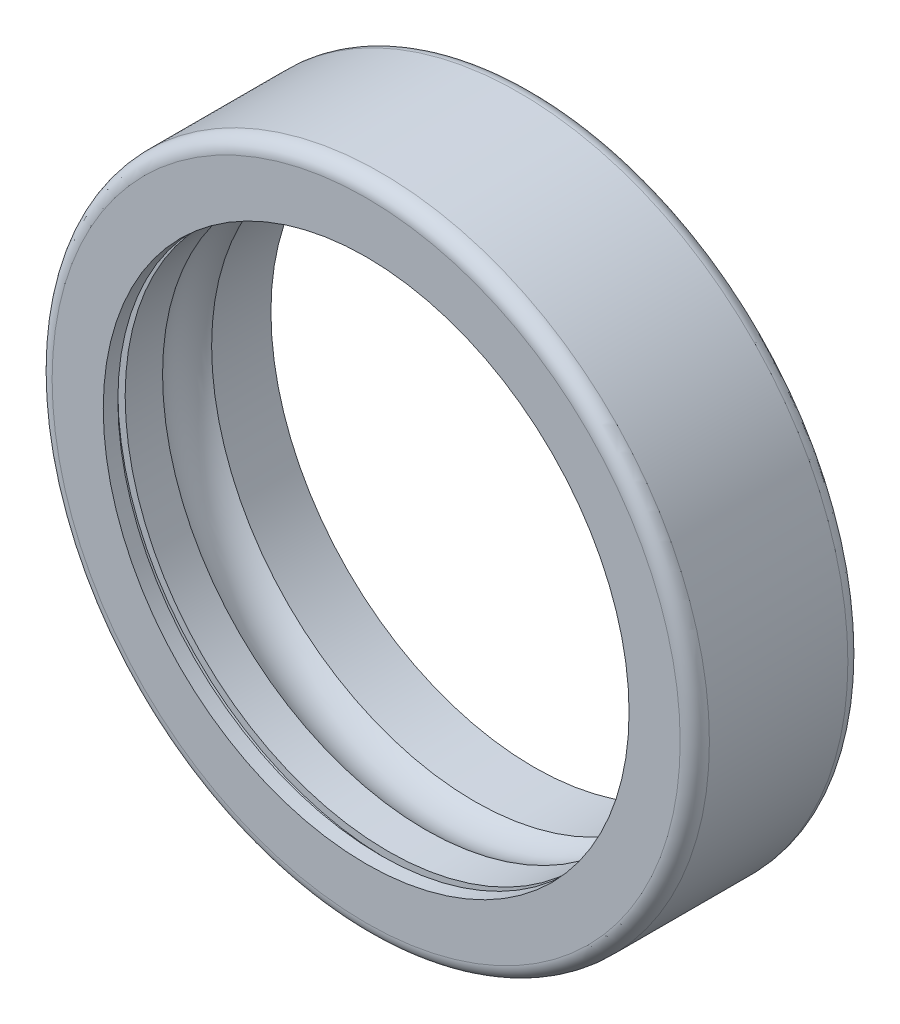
ISO-10303-21;
HEADER;
FILE_DESCRIPTION(('STEP AP214'),'2;1');
FILE_NAME('part.step','',(''),(''),'','','');
FILE_SCHEMA(('AUTOMOTIVE_DESIGN { 1 0 10303 214 1 1 1 1 }'));
ENDSEC;
DATA;
#1=APPLICATION_CONTEXT('core data for automotive mechanical design processes');
#2=APPLICATION_PROTOCOL_DEFINITION('international standard','automotive_design',2000,#1);
#3=PRODUCT_CONTEXT('',#1,'mechanical');
#4=PRODUCT('Part','Part','',(#3));
#5=PRODUCT_RELATED_PRODUCT_CATEGORY('part','',(#4));
#6=PRODUCT_DEFINITION_FORMATION('','',#4);
#7=PRODUCT_DEFINITION_CONTEXT('part definition',#1,'design');
#8=PRODUCT_DEFINITION('design','',#6,#7);
#9=PRODUCT_DEFINITION_SHAPE('','',#8);
#10=(LENGTH_UNIT() NAMED_UNIT(*) SI_UNIT(.MILLI.,.METRE.));
#11=(NAMED_UNIT(*) PLANE_ANGLE_UNIT() SI_UNIT($,.RADIAN.));
#12=(NAMED_UNIT(*) SI_UNIT($,.STERADIAN.) SOLID_ANGLE_UNIT());
#13=UNCERTAINTY_MEASURE_WITH_UNIT(LENGTH_MEASURE(1.E-05),#10,'distance_accuracy_value','');
#14=(GEOMETRIC_REPRESENTATION_CONTEXT(3) GLOBAL_UNCERTAINTY_ASSIGNED_CONTEXT((#13)) GLOBAL_UNIT_ASSIGNED_CONTEXT((#10,
#11,#12)) REPRESENTATION_CONTEXT('',''));
#15=CARTESIAN_POINT('',(0.,0.,0.));
#16=DIRECTION('',(0.,0.,1.));
#17=DIRECTION('',(1.,0.,0.));
#18=AXIS2_PLACEMENT_3D('',#15,#16,#17);
#19=CARTESIAN_POINT('',(0.,9.25,2.12));
#20=DIRECTION('',(0.,0.,1.));
#21=DIRECTION('',(1.,0.,0.));
#22=AXIS2_PLACEMENT_3D('',#19,#20,#21);
#23=PLANE('',#22);
#24=CARTESIAN_POINT('',(0.,0.,2.12));
#25=DIRECTION('',(0.,0.,-1.));
#26=DIRECTION('',(-1.,0.,0.));
#27=AXIS2_PLACEMENT_3D('',#24,#25,#26);
#28=CIRCLE('',#27,9.);
#29=CARTESIAN_POINT('',(-9.,0.,2.12));
#30=VERTEX_POINT('',#29);
#31=EDGE_CURVE('E10',#30,#30,#28,.T.);
#32=ORIENTED_EDGE('',*,*,#31,.T.);
#33=EDGE_LOOP('',(#32));
#34=FACE_BOUND('',#33,.T.);
#35=CARTESIAN_POINT('',(0.,0.,2.12));
#36=DIRECTION('',(0.,0.,-1.));
#37=DIRECTION('',(-1.,0.,0.));
#38=AXIS2_PLACEMENT_3D('',#35,#36,#37);
#39=CIRCLE('',#38,9.25);
#40=CARTESIAN_POINT('',(-9.25,0.,2.12));
#41=VERTEX_POINT('',#40);
#42=EDGE_CURVE('E70',#41,#41,#39,.T.);
#43=ORIENTED_EDGE('',*,*,#42,.F.);
#44=EDGE_LOOP('',(#43));
#45=FACE_BOUND('',#44,.T.);
#46=ADVANCED_FACE('F30',(#34,#45),#23,.T.);
#47=CARTESIAN_POINT('',(0.,0.,0.));
#48=DIRECTION('',(0.,0.,-1.));
#49=DIRECTION('',(-1.,0.,0.));
#50=AXIS2_PLACEMENT_3D('',#47,#48,#49);
#51=CYLINDRICAL_SURFACE('',#50,9.);
#52=ORIENTED_EDGE('',*,*,#31,.F.);
#53=EDGE_LOOP('',(#52));
#54=FACE_BOUND('',#53,.T.);
#55=CARTESIAN_POINT('',(0.,0.,0.840000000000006));
#56=DIRECTION('',(0.,0.,-1.));
#57=DIRECTION('',(-1.,0.,0.));
#58=AXIS2_PLACEMENT_3D('',#55,#56,#57);
#59=CIRCLE('',#58,9.);
#60=CARTESIAN_POINT('',(-9.,0.,0.840000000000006));
#61=VERTEX_POINT('',#60);
#62=EDGE_CURVE('E36',#61,#61,#59,.T.);
#63=ORIENTED_EDGE('',*,*,#62,.T.);
#64=EDGE_LOOP('',(#63));
#65=FACE_BOUND('',#64,.T.);
#66=ADVANCED_FACE('F78',(#54,#65),#51,.F.);
#67=CARTESIAN_POINT('',(0.,0.,0.));
#68=DIRECTION('',(0.,0.,-1.));
#69=DIRECTION('',(-1.,0.,0.));
#70=AXIS2_PLACEMENT_3D('',#67,#68,#69);
#71=TOROIDAL_SURFACE('',#70,7.88,1.4);
#72=ORIENTED_EDGE('',*,*,#62,.F.);
#73=EDGE_LOOP('',(#72));
#74=FACE_BOUND('',#73,.T.);
#75=CARTESIAN_POINT('',(0.,0.,-0.840000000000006));
#76=DIRECTION('',(0.,0.,-1.));
#77=DIRECTION('',(-1.,0.,0.));
#78=AXIS2_PLACEMENT_3D('',#75,#76,#77);
#79=CIRCLE('',#78,9.);
#80=CARTESIAN_POINT('',(-9.,0.,-0.840000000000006));
#81=VERTEX_POINT('',#80);
#82=EDGE_CURVE('E40',#81,#81,#79,.T.);
#83=ORIENTED_EDGE('',*,*,#82,.T.);
#84=EDGE_LOOP('',(#83));
#85=FACE_BOUND('',#84,.T.);
#86=ADVANCED_FACE('F82',(#74,#85),#71,.F.);
#87=CARTESIAN_POINT('',(0.,0.,0.));
#88=DIRECTION('',(0.,0.,-1.));
#89=DIRECTION('',(-1.,0.,0.));
#90=AXIS2_PLACEMENT_3D('',#87,#88,#89);
#91=CYLINDRICAL_SURFACE('',#90,9.);
#92=ORIENTED_EDGE('',*,*,#82,.F.);
#93=EDGE_LOOP('',(#92));
#94=FACE_BOUND('',#93,.T.);
#95=CARTESIAN_POINT('',(0.,0.,-2.87));
#96=DIRECTION('',(0.,0.,-1.));
#97=DIRECTION('',(-1.,0.,0.));
#98=AXIS2_PLACEMENT_3D('',#95,#96,#97);
#99=CIRCLE('',#98,9.);
#100=CARTESIAN_POINT('',(-9.,0.,-2.87));
#101=VERTEX_POINT('',#100);
#102=EDGE_CURVE('E44',#101,#101,#99,.T.);
#103=ORIENTED_EDGE('',*,*,#102,.T.);
#104=EDGE_LOOP('',(#103));
#105=FACE_BOUND('',#104,.T.);
#106=ADVANCED_FACE('F87',(#94,#105),#91,.F.);
#107=CARTESIAN_POINT('',(0.,9.,-2.87));
#108=DIRECTION('',(0.,0.,-1.));
#109=DIRECTION('',(-1.,0.,0.));
#110=AXIS2_PLACEMENT_3D('',#107,#108,#109);
#111=PLANE('',#110);
#112=CARTESIAN_POINT('',(0.,0.,-2.87));
#113=DIRECTION('',(0.,0.,-1.));
#114=DIRECTION('',(-1.,0.,0.));
#115=AXIS2_PLACEMENT_3D('',#112,#113,#114);
#116=CIRCLE('',#115,10.75);
#117=CARTESIAN_POINT('',(-10.75,0.,-2.87));
#118=VERTEX_POINT('',#117);
#119=EDGE_CURVE('E49',#118,#118,#116,.T.);
#120=ORIENTED_EDGE('',*,*,#119,.T.);
#121=EDGE_LOOP('',(#120));
#122=FACE_BOUND('',#121,.T.);
#123=ORIENTED_EDGE('',*,*,#102,.F.);
#124=EDGE_LOOP('',(#123));
#125=FACE_BOUND('',#124,.T.);
#126=ADVANCED_FACE('F93',(#122,#125),#111,.T.);
#127=CARTESIAN_POINT('',(0.,0.,-2.37));
#128=DIRECTION('',(0.,0.,-1.));
#129=DIRECTION('',(-1.,0.,0.));
#130=AXIS2_PLACEMENT_3D('',#127,#128,#129);
#131=TOROIDAL_SURFACE('',#130,10.75,0.499999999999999);
#132=CARTESIAN_POINT('',(0.,0.,-2.37));
#133=DIRECTION('',(0.,0.,-1.));
#134=DIRECTION('',(-1.,0.,0.));
#135=AXIS2_PLACEMENT_3D('',#132,#133,#134);
#136=CIRCLE('',#135,11.25);
#137=CARTESIAN_POINT('',(-11.25,0.,-2.37));
#138=VERTEX_POINT('',#137);
#139=EDGE_CURVE('E52',#138,#138,#136,.T.);
#140=ORIENTED_EDGE('',*,*,#139,.T.);
#141=EDGE_LOOP('',(#140));
#142=FACE_BOUND('',#141,.T.);
#143=ORIENTED_EDGE('',*,*,#119,.F.);
#144=EDGE_LOOP('',(#143));
#145=FACE_BOUND('',#144,.T.);
#146=ADVANCED_FACE('F97',(#142,#145),#131,.T.);
#147=CARTESIAN_POINT('',(0.,0.,0.));
#148=DIRECTION('',(0.,0.,-1.));
#149=DIRECTION('',(-1.,0.,0.));
#150=AXIS2_PLACEMENT_3D('',#147,#148,#149);
#151=CYLINDRICAL_SURFACE('',#150,11.25);
#152=ORIENTED_EDGE('',*,*,#139,.F.);
#153=EDGE_LOOP('',(#152));
#154=FACE_BOUND('',#153,.T.);
#155=CARTESIAN_POINT('',(0.,0.,2.37));
#156=DIRECTION('',(0.,0.,-1.));
#157=DIRECTION('',(-1.,0.,0.));
#158=AXIS2_PLACEMENT_3D('',#155,#156,#157);
#159=CIRCLE('',#158,11.25);
#160=CARTESIAN_POINT('',(-11.25,0.,2.37));
#161=VERTEX_POINT('',#160);
#162=EDGE_CURVE('E55',#161,#161,#159,.T.);
#163=ORIENTED_EDGE('',*,*,#162,.T.);
#164=EDGE_LOOP('',(#163));
#165=FACE_BOUND('',#164,.T.);
#166=ADVANCED_FACE('F101',(#154,#165),#151,.T.);
#167=CARTESIAN_POINT('',(0.,0.,2.37));
#168=DIRECTION('',(0.,0.,-1.));
#169=DIRECTION('',(-1.,0.,0.));
#170=AXIS2_PLACEMENT_3D('',#167,#168,#169);
#171=TOROIDAL_SURFACE('',#170,10.75,0.499999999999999);
#172=ORIENTED_EDGE('',*,*,#162,.F.);
#173=EDGE_LOOP('',(#172));
#174=FACE_BOUND('',#173,.T.);
#175=CARTESIAN_POINT('',(0.,0.,2.87));
#176=DIRECTION('',(0.,0.,-1.));
#177=DIRECTION('',(-1.,0.,0.));
#178=AXIS2_PLACEMENT_3D('',#175,#176,#177);
#179=CIRCLE('',#178,10.75);
#180=CARTESIAN_POINT('',(-10.75,0.,2.87));
#181=VERTEX_POINT('',#180);
#182=EDGE_CURVE('E58',#181,#181,#179,.T.);
#183=ORIENTED_EDGE('',*,*,#182,.T.);
#184=EDGE_LOOP('',(#183));
#185=FACE_BOUND('',#184,.T.);
#186=ADVANCED_FACE('F105',(#174,#185),#171,.T.);
#187=CARTESIAN_POINT('',(0.,10.75,2.87));
#188=DIRECTION('',(0.,0.,1.));
#189=DIRECTION('',(1.,0.,0.));
#190=AXIS2_PLACEMENT_3D('',#187,#188,#189);
#191=PLANE('',#190);
#192=CARTESIAN_POINT('',(0.,0.,2.87));
#193=DIRECTION('',(0.,0.,-1.));
#194=DIRECTION('',(-1.,0.,0.));
#195=AXIS2_PLACEMENT_3D('',#192,#193,#194);
#196=CIRCLE('',#195,9.);
#197=CARTESIAN_POINT('',(-9.,0.,2.87));
#198=VERTEX_POINT('',#197);
#199=EDGE_CURVE('E61',#198,#198,#196,.T.);
#200=ORIENTED_EDGE('',*,*,#199,.T.);
#201=EDGE_LOOP('',(#200));
#202=FACE_BOUND('',#201,.T.);
#203=ORIENTED_EDGE('',*,*,#182,.F.);
#204=EDGE_LOOP('',(#203));
#205=FACE_BOUND('',#204,.T.);
#206=ADVANCED_FACE('F109',(#202,#205),#191,.T.);
#207=CARTESIAN_POINT('',(0.,0.,0.));
#208=DIRECTION('',(0.,0.,-1.));
#209=DIRECTION('',(-1.,0.,0.));
#210=AXIS2_PLACEMENT_3D('',#207,#208,#209);
#211=CYLINDRICAL_SURFACE('',#210,9.);
#212=ORIENTED_EDGE('',*,*,#199,.F.);
#213=EDGE_LOOP('',(#212));
#214=FACE_BOUND('',#213,.T.);
#215=CARTESIAN_POINT('',(0.,0.,2.37));
#216=DIRECTION('',(0.,0.,-1.));
#217=DIRECTION('',(-1.,0.,0.));
#218=AXIS2_PLACEMENT_3D('',#215,#216,#217);
#219=CIRCLE('',#218,9.);
#220=CARTESIAN_POINT('',(-9.,0.,2.37));
#221=VERTEX_POINT('',#220);
#222=EDGE_CURVE('E64',#221,#221,#219,.T.);
#223=ORIENTED_EDGE('',*,*,#222,.T.);
#224=EDGE_LOOP('',(#223));
#225=FACE_BOUND('',#224,.T.);
#226=ADVANCED_FACE('F113',(#214,#225),#211,.F.);
#227=CARTESIAN_POINT('',(0.,9.,2.37));
#228=DIRECTION('',(0.,0.,-1.));
#229=DIRECTION('',(-1.,0.,0.));
#230=AXIS2_PLACEMENT_3D('',#227,#228,#229);
#231=PLANE('',#230);
#232=CARTESIAN_POINT('',(0.,0.,2.37));
#233=DIRECTION('',(0.,0.,-1.));
#234=DIRECTION('',(-1.,0.,0.));
#235=AXIS2_PLACEMENT_3D('',#232,#233,#234);
#236=CIRCLE('',#235,9.25);
#237=CARTESIAN_POINT('',(-9.25,0.,2.37));
#238=VERTEX_POINT('',#237);
#239=EDGE_CURVE('E67',#238,#238,#236,.T.);
#240=ORIENTED_EDGE('',*,*,#239,.T.);
#241=EDGE_LOOP('',(#240));
#242=FACE_BOUND('',#241,.T.);
#243=ORIENTED_EDGE('',*,*,#222,.F.);
#244=EDGE_LOOP('',(#243));
#245=FACE_BOUND('',#244,.T.);
#246=ADVANCED_FACE('F117',(#242,#245),#231,.T.);
#247=CARTESIAN_POINT('',(0.,0.,0.));
#248=DIRECTION('',(0.,0.,-1.));
#249=DIRECTION('',(-1.,0.,0.));
#250=AXIS2_PLACEMENT_3D('',#247,#248,#249);
#251=CYLINDRICAL_SURFACE('',#250,9.25);
#252=ORIENTED_EDGE('',*,*,#42,.T.);
#253=EDGE_LOOP('',(#252));
#254=FACE_BOUND('',#253,.T.);
#255=ORIENTED_EDGE('',*,*,#239,.F.);
#256=EDGE_LOOP('',(#255));
#257=FACE_BOUND('',#256,.T.);
#258=ADVANCED_FACE('F74',(#254,#257),#251,.F.);
#259=CLOSED_SHELL('',(#46,#66,#86,#106,#126,#146,#166,#186,#206,#226,#246,#258));
#260=MANIFOLD_SOLID_BREP('B2',#259);
#261=ADVANCED_BREP_SHAPE_REPRESENTATION('',(#18,#260),#14);
#262=SHAPE_DEFINITION_REPRESENTATION(#9,#261);
ENDSEC;
END-ISO-10303-21;
